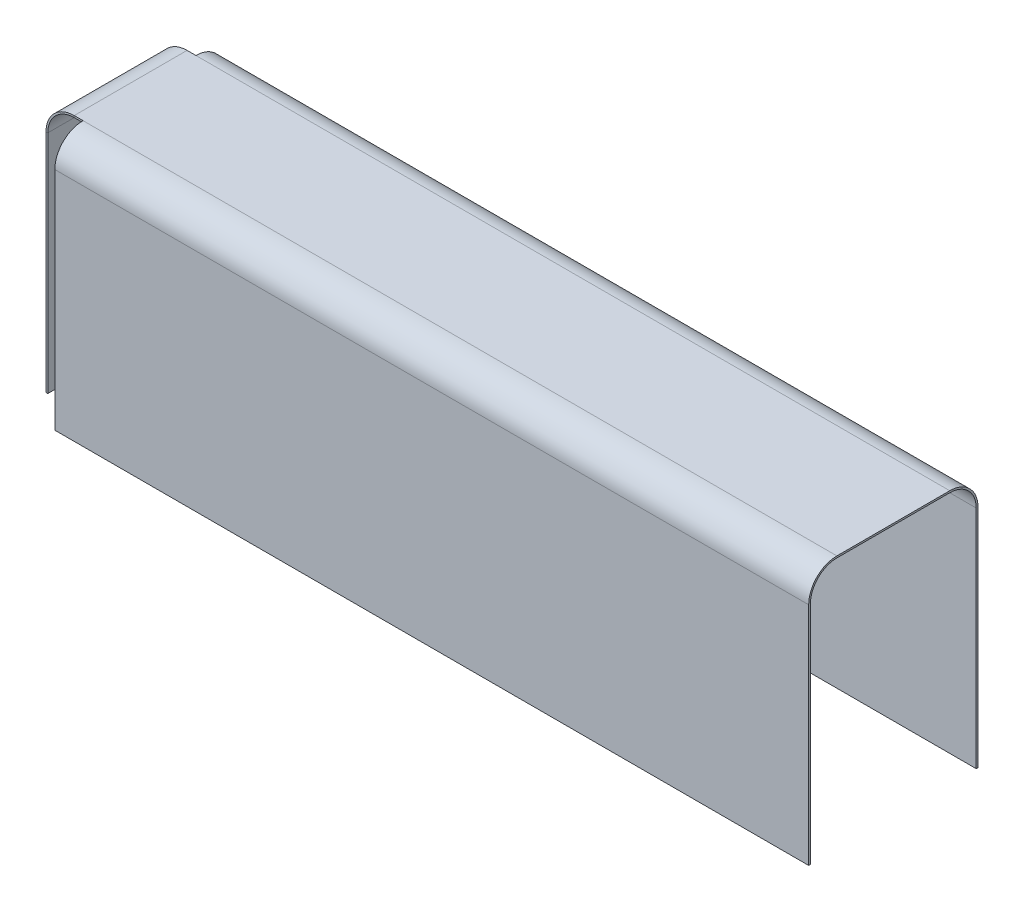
from build123d import *

# Parameters (mm, degrees)
SKETCH1_W           = 339.26145
SKETCH1_H           = 76.2
BOSS_EXTRUDE1_DEPTH = 114.3
FILLET1_R           = 12.7
SHELL1_T            = -0.79375
SKETCH2_W           = 50.8
SKETCH2_H           = 0.79375
SKETCH4_R           = 2.54
CUT_EXTRUDE1_DEPTH  = 2.54


with BuildPart() as part:
    # Sketch1 → Boss-Extrude1 (new body)
    with BuildSketch(Plane(origin=(0, 0, 0), x_dir=(1, 0, 0), z_dir=(0, 1, 0))):
        Rectangle(SKETCH1_W, SKETCH1_H)
    extrude(amount=BOSS_EXTRUDE1_DEPTH)

    # Fillet1
    fillet1_edges = [part.edges().sort_by_distance(p)[0] for p in [
        (0, 114.3, -38.1),
        (0, 114.3, 38.1),
    ]]
    fillet(fillet1_edges, radius=FILLET1_R)

    # Shell1
    shell1_openings = [part.faces().sort_by_distance(p)[0] for p in [
        (0, 0, 0),
        (169.630725, 56.714848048, 0),
        (-169.630725, 56.714848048, 0),
    ]]
    offset(amount=SHELL1_T, openings=shell1_openings, kind=Kind.INTERSECTION)

    # Sweep1: sweep along a path in Sketch3
    with BuildLine(Plane.XY) as sweep1_path:
        Line((-186.299475, 0), (-186.299475, 101.6))
        ThreePointArc((-186.299475, 101.6), (-182.579731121, 110.580256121), (-173.599475, 114.3))
        Line((-173.599475, 114.3), (-169.630725, 114.3))
    # Sketch2 → Sweep1 (sweep)
    with BuildSketch(Plane.ZY.offset(169.630725)):
        with Locations((0, 113.903125)):
            Rectangle(SKETCH2_W, SKETCH2_H)
    sweep(path=sweep1_path.line)

    # Sketch4 → Cut-Extrude1 (cut)
    with BuildSketch(Plane.ZY.offset(186.299475)):
        with Locations((0, 22.5425)):
            Circle(SKETCH4_R)
    extrude(amount=-CUT_EXTRUDE1_DEPTH, mode=Mode.SUBTRACT)


solid = part.part
